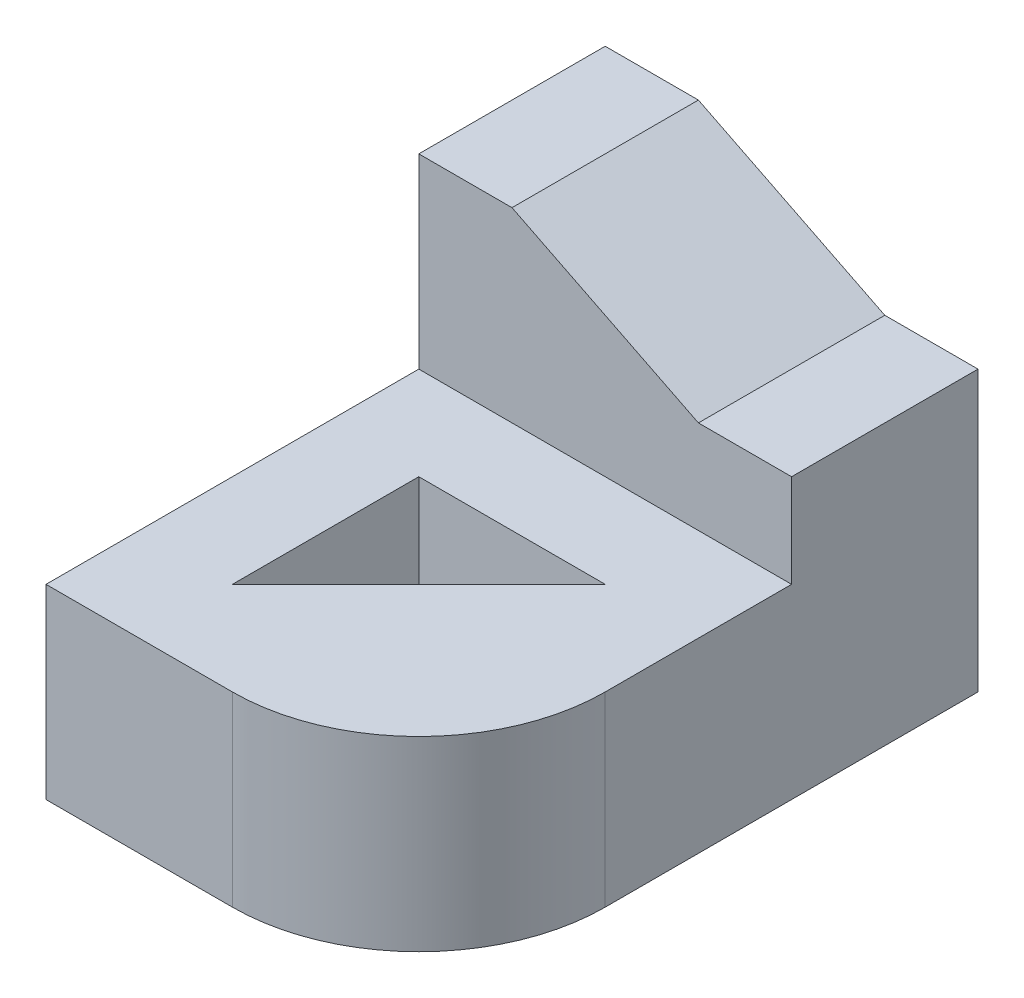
from build123d import *

# Parameters (mm, degrees)
SKETCH1_W      = 40
SKETCH1_H      = 20
EXTRUDE1_DEPTH = 60
EXTRUDE2_DEPTH = 20
EXTRUDE3_DEPTH = 75.833147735
FILLET1_R      = 20


with BuildPart() as part:
    # Sketch1 → Extrude1 (new body)
    with BuildSketch(Plane.XY):
        with Locations((20, 10)):
            Rectangle(SKETCH1_W, SKETCH1_H)
    extrude(amount=EXTRUDE1_DEPTH)

    # Sketch → Extrude2 (add)
    with BuildSketch(Plane.XY):
        Polygon((40, 30), (40, 20), (0, 20), (0, 40), (10, 40), (30, 30), align=None)
    extrude(amount=EXTRUDE2_DEPTH)

    # Sketch2 → Extrude3 (cut, through all)
    with BuildSketch(Plane(origin=(0, 20, 0), x_dir=(1, 0, 0), z_dir=(0, 1, 0))):
        Polygon((10, -50), (10, -30), (30, -30), align=None)
    extrude(amount=-EXTRUDE3_DEPTH, mode=Mode.SUBTRACT)

    # Fillet1
    fillet1_edges = [part.edges().sort_by_distance(p)[0] for p in [
        (40, 10, 60),
    ]]
    fillet(fillet1_edges, radius=FILLET1_R)


solid = part.part
